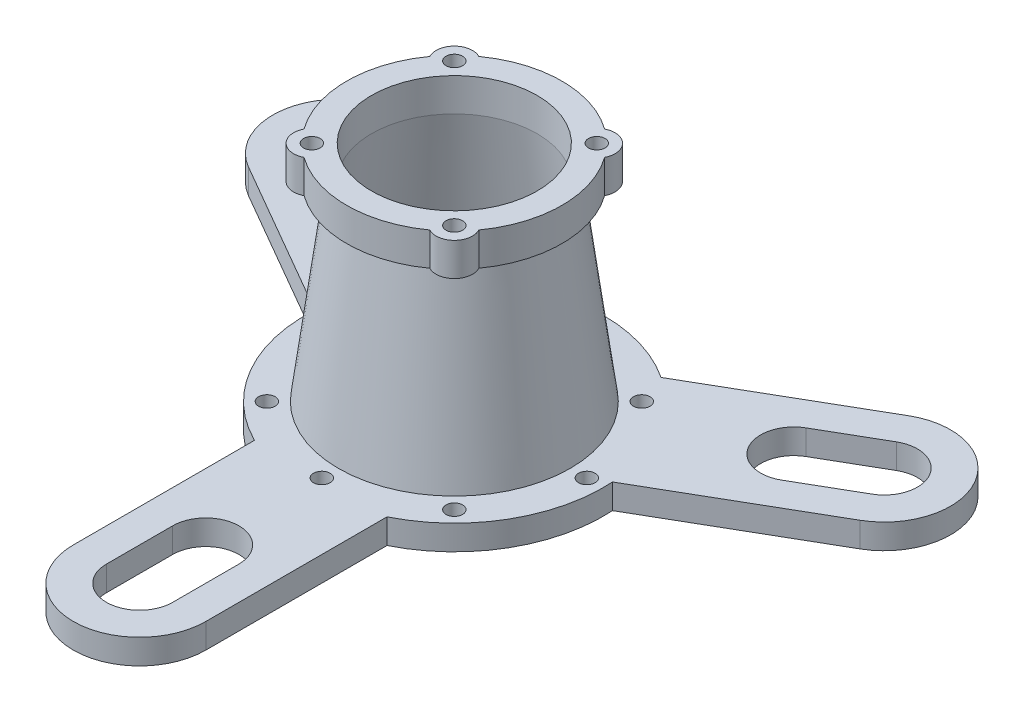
from build123d import *

# Parameters (mm, degrees)
SKETCH5_R           = 90
SKETCH5_R_2         = 70
BOSS_EXTRUDE1_DEPTH = 15
BOSS_EXTRUDE2_DEPTH = 15
CIRPATTERN1_COUNT   = 3
SKETCH7_R           = 5
CUT_EXTRUDE1_DEPTH  = 15
CIRPATTERN2_COUNT   = 8
SKETCH8_R           = 11
SKETCH8_R_2         = 5
BOSS_EXTRUDE3_DEPTH = 20
SKETCH8_4_R         = 5
CUT_EXTRUDE2_DEPTH  = 20
SKETCH11_R          = 50
CUT_EXTRUDE3_DEPTH  = 20
BOSS_EXTRUDE4_START = 15
SKETCH12_R          = 70
SKETCH12_R_2        = 65
BOSS_EXTRUDE4_DEPTH = 15


with BuildPart() as part:
    # Sketch3 → Revolve1 (revolve)
    with BuildSketch(Plane.XY, mode=Mode.PRIVATE) as revolve1_sk:
        Polygon((50, 135), (65, 135), (65, 115), (55, 115), (70, 0), (65, 0), (50, 115), align=None)
    revolve(revolve1_sk.sketch.rotate(Axis((0, 0, 0), (0, 1, 0)), 90), axis=Axis((0, 0, 0), (0, 1, 0)))

    # Sketch8 → Boss-Extrude3 (add)
    # profile 1 of 4: a face of its own
    with BuildSketch(Plane(origin=(0, 135, 0), x_dir=(1, 0, 0), z_dir=(0, 1, 0))):
        with Locations((-43, -43)):
            Circle(SKETCH8_R)
        with Locations((-43, -43)):
            Circle(SKETCH8_R_2, mode=Mode.SUBTRACT)
    # profile 2 of 4: a face of its own
    with BuildSketch(Plane(origin=(0, 135, 0), x_dir=(1, 0, 0), z_dir=(0, 1, 0))):
        with Locations((-43, 43)):
            Circle(SKETCH8_R)
        with Locations((-43, 43)):
            Circle(SKETCH8_R_2, mode=Mode.SUBTRACT)
    # profile 3 of 4: a face of its own
    with BuildSketch(Plane(origin=(0, 135, 0), x_dir=(1, 0, 0), z_dir=(0, 1, 0))):
        with Locations((43, 43)):
            Circle(SKETCH8_R)
        with Locations((43, 43)):
            Circle(SKETCH8_R_2, mode=Mode.SUBTRACT)
    # profile 4 of 4: a face of its own
    with BuildSketch(Plane(origin=(0, 135, 0), x_dir=(1, 0, 0), z_dir=(0, 1, 0))):
        with Locations((43, -43)):
            Circle(SKETCH8_R)
        with Locations((43, -43)):
            Circle(SKETCH8_R_2, mode=Mode.SUBTRACT)
    extrude(amount=-BOSS_EXTRUDE3_DEPTH)

    # Sketch8_4 → Cut-Extrude2 (cut)
    with BuildSketch(Plane(origin=(0, 135, 0), x_dir=(1, 0, 0), z_dir=(0, 1, 0))):
        with Locations(Location((43, 43, 0), (0, 0, 270))):
            Circle(SKETCH8_4_R)
        with Locations(Location((-43, 43, 0), (0, 0, 270))):
            Circle(SKETCH8_4_R)
        with Locations(Location((43, -43, 0), (0, 0, 270))):
            Circle(SKETCH8_4_R)
        with Locations(Location((-43, -43, 0), (0, 0, 270))):
            Circle(SKETCH8_4_R)
    extrude(amount=-CUT_EXTRUDE2_DEPTH, mode=Mode.SUBTRACT)

    # Sketch11 → Cut-Extrude3 (cut)
    with BuildSketch(Plane(origin=(0, 135, 0), x_dir=(1, 0, 0), z_dir=(0, 1, 0))):
        with Locations(Location((0, 0, 0), (0, 0, 90))):
            Circle(SKETCH11_R)
    extrude(amount=-CUT_EXTRUDE3_DEPTH, mode=Mode.SUBTRACT)



with BuildPart() as body_2:
    # Sketch5 → Boss-Extrude1 (new body)
    with BuildSketch(Plane(origin=(0, 0, 0), x_dir=(-1, 0, 0), z_dir=(0, -1, 0))):
        with Locations(Location((0, 0, 0), (0, 0, 90))):
            Circle(SKETCH5_R)
        with Locations(Location((0, 0, 0), (0, 0, 90))):
            Circle(SKETCH5_R_2, mode=Mode.SUBTRACT)
    extrude(amount=BOSS_EXTRUDE1_DEPTH)

    # Sketch6 → Boss-Extrude2 (add)
    with BuildSketch(Plane(origin=(0, 0, 0), x_dir=(1, 0, 0), z_dir=(0, 1, 0))):
        with BuildLine():
            Line((-40, -190), (-40, -80.622577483))
            ThreePointArc((-40, -80.622577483), (0, -90), (40, -80.622577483))
            Line((40, -80.622577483), (40, -190))
            ThreePointArc((40, -190), (0, -230), (-40, -190))
        make_face()
        with BuildLine():
            Line((-20, -190), (-20, -150))
            ThreePointArc((-20, -150), (0, -130), (20, -150))
            Line((20, -150), (20, -190))
            ThreePointArc((20, -190), (0, -210), (-20, -190))
        make_face(mode=Mode.SUBTRACT)
    boss_extrude2 = extrude(amount=-BOSS_EXTRUDE2_DEPTH)

    # CirPattern1: Boss-Extrude2 ×3 about axis
    cirpattern1_axis = Axis((0, 0, 0), (0, 1, 0))
    for i in range(1, CIRPATTERN1_COUNT):
        add(boss_extrude2.rotate(cirpattern1_axis, i * 360 / CIRPATTERN1_COUNT))

    # Sketch7 → Cut-Extrude1 (cut)
    with BuildSketch(Plane(origin=(0, 0, 0), x_dir=(1, 0, 0), z_dir=(0, 1, 0))):
        with Locations(Location((80, 0, 0), (0, 0, 270))):
            Circle(SKETCH7_R)
    cut_extrude1 = extrude(amount=-CUT_EXTRUDE1_DEPTH, mode=Mode.SUBTRACT)

    # CirPattern2: Cut-Extrude1 ×8 about axis
    cirpattern2_axis = Axis((0, 0, 0), (0, 1, 0))
    for i in range(1, CIRPATTERN2_COUNT):
        add(cut_extrude1.rotate(cirpattern2_axis, i * 360 / CIRPATTERN2_COUNT), mode=Mode.SUBTRACT)


with BuildPart() as part_1:
    add(part.part)

    add(body_2.part)  # Boss-Extrude4 merges body 2
    # Sketch12 → Boss-Extrude4 (add)
    with BuildSketch(Plane.XZ.offset(BOSS_EXTRUDE4_START)):
        Circle(SKETCH12_R)
        with Locations(Location((0, 0, 0), (0, 0, 90))):
            Circle(SKETCH12_R_2, mode=Mode.SUBTRACT)
    extrude(amount=-BOSS_EXTRUDE4_DEPTH)


solid = part_1.part
